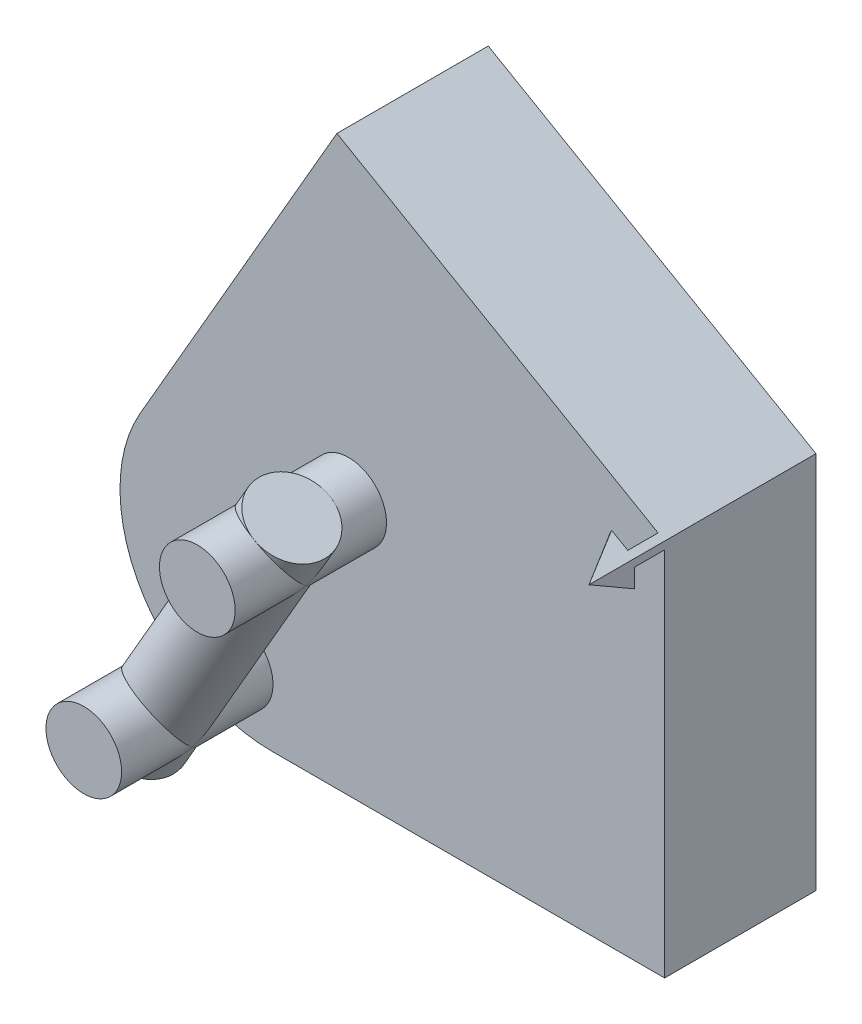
ISO-10303-21;
HEADER;
FILE_DESCRIPTION(('STEP AP214'),'2;1');
FILE_NAME('part.step','',(''),(''),'','','');
FILE_SCHEMA(('AUTOMOTIVE_DESIGN { 1 0 10303 214 1 1 1 1 }'));
ENDSEC;
DATA;
#1=APPLICATION_CONTEXT('core data for automotive mechanical design processes');
#2=APPLICATION_PROTOCOL_DEFINITION('international standard','automotive_design',2000,#1);
#3=PRODUCT_CONTEXT('',#1,'mechanical');
#4=PRODUCT('Part','Part','',(#3));
#5=PRODUCT_RELATED_PRODUCT_CATEGORY('part','',(#4));
#6=PRODUCT_DEFINITION_FORMATION('','',#4);
#7=PRODUCT_DEFINITION_CONTEXT('part definition',#1,'design');
#8=PRODUCT_DEFINITION('design','',#6,#7);
#9=PRODUCT_DEFINITION_SHAPE('','',#8);
#10=(LENGTH_UNIT() NAMED_UNIT(*) SI_UNIT(.MILLI.,.METRE.));
#11=(NAMED_UNIT(*) PLANE_ANGLE_UNIT() SI_UNIT($,.RADIAN.));
#12=(NAMED_UNIT(*) SI_UNIT($,.STERADIAN.) SOLID_ANGLE_UNIT());
#13=UNCERTAINTY_MEASURE_WITH_UNIT(LENGTH_MEASURE(1.E-05),#10,'distance_accuracy_value','');
#14=(GEOMETRIC_REPRESENTATION_CONTEXT(3) GLOBAL_UNCERTAINTY_ASSIGNED_CONTEXT((#13)) GLOBAL_UNIT_ASSIGNED_CONTEXT((#10,
#11,#12)) REPRESENTATION_CONTEXT('',''));
#15=CARTESIAN_POINT('',(0.,0.,0.));
#16=DIRECTION('',(0.,0.,1.));
#17=DIRECTION('',(1.,0.,0.));
#18=AXIS2_PLACEMENT_3D('',#15,#16,#17);
#19=CARTESIAN_POINT('',(-43.3012701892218,-25.,10.));
#20=DIRECTION('',(0.86602540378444,-0.499999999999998,0.));
#21=DIRECTION('',(0.499999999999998,0.86602540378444,0.));
#22=AXIS2_PLACEMENT_3D('',#19,#20,#21);
#23=PLANE('',#22);
#24=DIRECTION('',(0.,0.,-1.));
#25=VECTOR('',#24,1.);
#26=CARTESIAN_POINT('',(-21.650635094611,12.4999999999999,24.));
#27=LINE('',#26,#25);
#28=CARTESIAN_POINT('',(-21.650635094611,12.4999999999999,10.));
#29=VERTEX_POINT('',#28);
#30=CARTESIAN_POINT('',(-21.650635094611,12.4999999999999,0.));
#31=VERTEX_POINT('',#30);
#32=EDGE_CURVE('E129',#29,#31,#27,.T.);
#33=ORIENTED_EDGE('',*,*,#32,.T.);
#34=DIRECTION('',(-0.499999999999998,-0.86602540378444,0.));
#35=VECTOR('',#34,1.);
#36=CARTESIAN_POINT('',(-43.3012701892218,-25.,0.));
#37=LINE('',#36,#35);
#38=CARTESIAN_POINT('',(-34.6410161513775,-10.,0.));
#39=VERTEX_POINT('',#38);
#40=EDGE_CURVE('E141',#31,#39,#37,.T.);
#41=ORIENTED_EDGE('',*,*,#40,.T.);
#42=DIRECTION('',(0.,0.,-1.));
#43=VECTOR('',#42,1.);
#44=CARTESIAN_POINT('',(-34.6410161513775,-10.,10.));
#45=LINE('',#44,#43);
#46=CARTESIAN_POINT('',(-34.6410161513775,-10.,10.));
#47=VERTEX_POINT('',#46);
#48=EDGE_CURVE('E167',#39,#47,#45,.F.);
#49=ORIENTED_EDGE('',*,*,#48,.T.);
#50=DIRECTION('',(-0.499999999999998,-0.86602540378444,0.));
#51=VECTOR('',#50,1.);
#52=CARTESIAN_POINT('',(-43.3012701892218,-25.,10.));
#53=LINE('',#52,#51);
#54=EDGE_CURVE('E143',#29,#47,#53,.T.);
#55=ORIENTED_EDGE('',*,*,#54,.F.);
#56=EDGE_LOOP('',(#33,#41,#49,#55));
#57=FACE_BOUND('',#56,.T.);
#58=ADVANCED_FACE('F36',(#57),#23,.F.);
#59=CARTESIAN_POINT('',(43.3012701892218,-25.,10.));
#60=DIRECTION('',(0.,1.,0.));
#61=DIRECTION('',(-1.,0.,0.));
#62=AXIS2_PLACEMENT_3D('',#59,#60,#61);
#63=PLANE('',#62);
#64=DIRECTION('',(0.,0.,-1.));
#65=VECTOR('',#64,1.);
#66=CARTESIAN_POINT('',(0.,-25.,24.));
#67=LINE('',#66,#65);
#68=CARTESIAN_POINT('',(0.,-25.,10.));
#69=VERTEX_POINT('',#68);
#70=CARTESIAN_POINT('',(0.,-25.,0.));
#71=VERTEX_POINT('',#70);
#72=EDGE_CURVE('E226',#69,#71,#67,.T.);
#73=ORIENTED_EDGE('',*,*,#72,.F.);
#74=DIRECTION('',(1.,0.,0.));
#75=VECTOR('',#74,1.);
#76=CARTESIAN_POINT('',(43.3012701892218,-25.,10.));
#77=LINE('',#76,#75);
#78=CARTESIAN_POINT('',(-25.9807621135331,-25.,10.));
#79=VERTEX_POINT('',#78);
#80=EDGE_CURVE('E158',#79,#69,#77,.T.);
#81=ORIENTED_EDGE('',*,*,#80,.F.);
#82=DIRECTION('',(0.,0.,-1.));
#83=VECTOR('',#82,1.);
#84=CARTESIAN_POINT('',(-25.9807621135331,-25.,10.));
#85=LINE('',#84,#83);
#86=CARTESIAN_POINT('',(-25.9807621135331,-25.,0.));
#87=VERTEX_POINT('',#86);
#88=EDGE_CURVE('E162',#79,#87,#85,.T.);
#89=ORIENTED_EDGE('',*,*,#88,.T.);
#90=DIRECTION('',(1.,0.,0.));
#91=VECTOR('',#90,1.);
#92=CARTESIAN_POINT('',(43.3012701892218,-25.,0.));
#93=LINE('',#92,#91);
#94=EDGE_CURVE('E149',#87,#71,#93,.T.);
#95=ORIENTED_EDGE('',*,*,#94,.T.);
#96=EDGE_LOOP('',(#73,#81,#89,#95));
#97=FACE_BOUND('',#96,.T.);
#98=ADVANCED_FACE('F225',(#97),#63,.F.);
#99=CARTESIAN_POINT('',(43.3012701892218,-25.,10.));
#100=DIRECTION('',(0.,0.,-1.));
#101=DIRECTION('',(-1.,0.,0.));
#102=AXIS2_PLACEMENT_3D('',#99,#100,#101);
#103=PLANE('',#102);
#104=CARTESIAN_POINT('',(-28.3743556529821,-21.1458256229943,10.));
#105=DIRECTION('',(0.,0.,-1.));
#106=DIRECTION('',(-1.,0.,0.));
#107=AXIS2_PLACEMENT_3D('',#104,#105,#106);
#108=CIRCLE('',#107,2.5);
#109=CARTESIAN_POINT('',(-30.8743556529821,-21.1458256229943,10.));
#110=VERTEX_POINT('',#109);
#111=EDGE_CURVE('E150',#110,#110,#108,.T.);
#112=ORIENTED_EDGE('',*,*,#111,.T.);
#113=EDGE_LOOP('',(#112));
#114=FACE_BOUND('',#113,.T.);
#115=CARTESIAN_POINT('',(-20.8743556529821,-8.15544456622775,10.));
#116=DIRECTION('',(0.,0.,-1.));
#117=DIRECTION('',(-1.,0.,0.));
#118=AXIS2_PLACEMENT_3D('',#115,#116,#117);
#119=CIRCLE('',#118,2.5);
#120=CARTESIAN_POINT('',(-23.3743556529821,-8.15544456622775,10.));
#121=VERTEX_POINT('',#120);
#122=EDGE_CURVE('E209',#121,#121,#119,.T.);
#123=ORIENTED_EDGE('',*,*,#122,.T.);
#124=EDGE_LOOP('',(#123));
#125=FACE_BOUND('',#124,.T.);
#126=DIRECTION('',(0.86602540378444,-0.499999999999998,0.));
#127=VECTOR('',#126,1.);
#128=CARTESIAN_POINT('',(43.3012701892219,-24.9999999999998,10.));
#129=LINE('',#128,#127);
#130=CARTESIAN_POINT('',(-0.43301270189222,0.249999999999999,10.));
#131=VERTEX_POINT('',#130);
#132=EDGE_CURVE('E301',#29,#131,#129,.T.);
#133=ORIENTED_EDGE('',*,*,#132,.F.);
#134=ORIENTED_EDGE('',*,*,#54,.T.);
#135=CARTESIAN_POINT('',(-25.9807621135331,-15.,10.));
#136=DIRECTION('',(0.,0.,-1.));
#137=DIRECTION('',(-1.,0.,0.));
#138=AXIS2_PLACEMENT_3D('',#135,#136,#137);
#139=CIRCLE('',#138,10.);
#140=EDGE_CURVE('E165',#47,#79,#139,.F.);
#141=ORIENTED_EDGE('',*,*,#140,.T.);
#142=ORIENTED_EDGE('',*,*,#80,.T.);
#143=DIRECTION('',(0.,-1.,0.));
#144=VECTOR('',#143,1.);
#145=CARTESIAN_POINT('',(0.,-25.,10.));
#146=LINE('',#145,#144);
#147=CARTESIAN_POINT('',(0.,-0.5,10.));
#148=VERTEX_POINT('',#147);
#149=EDGE_CURVE('E219',#148,#69,#146,.T.);
#150=ORIENTED_EDGE('',*,*,#149,.F.);
#151=CARTESIAN_POINT('',(0.,0.,10.));
#152=DIRECTION('',(0.,0.,-1.));
#153=DIRECTION('',(0.,1.,0.));
#154=AXIS2_PLACEMENT_3D('',#151,#152,#153);
#155=CIRCLE('',#154,0.5);
#156=EDGE_CURVE('E308',#148,#131,#155,.T.);
#157=ORIENTED_EDGE('',*,*,#156,.T.);
#158=EDGE_LOOP('',(#133,#134,#141,#142,#150,#157));
#159=FACE_BOUND('',#158,.T.);
#160=ADVANCED_FACE('F217',(#114,#125,#159),#103,.F.);
#161=CARTESIAN_POINT('',(43.3012701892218,-25.,0.));
#162=DIRECTION('',(0.,0.,-1.));
#163=DIRECTION('',(-1.,0.,0.));
#164=AXIS2_PLACEMENT_3D('',#161,#162,#163);
#165=PLANE('',#164);
#166=ORIENTED_EDGE('',*,*,#40,.F.);
#167=DIRECTION('',(0.86602540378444,-0.499999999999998,0.));
#168=VECTOR('',#167,1.);
#169=CARTESIAN_POINT('',(-21.650635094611,12.4999999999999,0.));
#170=LINE('',#169,#168);
#171=CARTESIAN_POINT('',(0.,0.,0.));
#172=VERTEX_POINT('',#171);
#173=EDGE_CURVE('E126',#31,#172,#170,.T.);
#174=ORIENTED_EDGE('',*,*,#173,.T.);
#175=DIRECTION('',(0.,-1.,0.));
#176=VECTOR('',#175,1.);
#177=CARTESIAN_POINT('',(0.,0.,0.));
#178=LINE('',#177,#176);
#179=EDGE_CURVE('E136',#172,#71,#178,.T.);
#180=ORIENTED_EDGE('',*,*,#179,.T.);
#181=ORIENTED_EDGE('',*,*,#94,.F.);
#182=CARTESIAN_POINT('',(-25.9807621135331,-15.,0.));
#183=DIRECTION('',(0.,0.,-1.));
#184=DIRECTION('',(-1.,0.,0.));
#185=AXIS2_PLACEMENT_3D('',#182,#183,#184);
#186=CIRCLE('',#185,10.);
#187=EDGE_CURVE('E147',#87,#39,#186,.T.);
#188=ORIENTED_EDGE('',*,*,#187,.T.);
#189=EDGE_LOOP('',(#166,#174,#180,#181,#188));
#190=FACE_BOUND('',#189,.T.);
#191=ADVANCED_FACE('F145',(#190),#165,.T.);
#192=CARTESIAN_POINT('',(0.,0.,0.));
#193=DIRECTION('',(0.,0.,-1.));
#194=DIRECTION('',(0.,1.,0.));
#195=AXIS2_PLACEMENT_3D('',#192,#193,#194);
#196=CYLINDRICAL_SURFACE('',#195,0.5);
#197=CARTESIAN_POINT('',(0.,0.,12.));
#198=DIRECTION('',(0.,0.,-1.));
#199=DIRECTION('',(0.,1.,0.));
#200=AXIS2_PLACEMENT_3D('',#197,#198,#199);
#201=CIRCLE('',#200,0.5);
#202=CARTESIAN_POINT('',(0.,-0.5,12.));
#203=VERTEX_POINT('',#202);
#204=CARTESIAN_POINT('',(-0.43301270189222,0.249999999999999,12.));
#205=VERTEX_POINT('',#204);
#206=EDGE_CURVE('E303',#203,#205,#201,.T.);
#207=ORIENTED_EDGE('',*,*,#206,.T.);
#208=DIRECTION('',(0.,0.,-1.));
#209=VECTOR('',#208,1.);
#210=CARTESIAN_POINT('',(-0.43301270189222,0.249999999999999,0.));
#211=LINE('',#210,#209);
#212=EDGE_CURVE('E294',#205,#131,#211,.T.);
#213=ORIENTED_EDGE('',*,*,#212,.T.);
#214=ORIENTED_EDGE('',*,*,#156,.F.);
#215=DIRECTION('',(0.,0.,-1.));
#216=VECTOR('',#215,1.);
#217=CARTESIAN_POINT('',(0.,-0.5,0.));
#218=LINE('',#217,#216);
#219=EDGE_CURVE('E290',#148,#203,#218,.F.);
#220=ORIENTED_EDGE('',*,*,#219,.T.);
#221=EDGE_LOOP('',(#207,#213,#214,#220));
#222=FACE_BOUND('',#221,.T.);
#223=ADVANCED_FACE('F247',(#222),#196,.T.);
#224=CARTESIAN_POINT('',(0.,0.,12.));
#225=DIRECTION('',(0.,0.,-1.));
#226=DIRECTION('',(0.,1.,0.));
#227=AXIS2_PLACEMENT_3D('',#224,#225,#226);
#228=CONICAL_SURFACE('',#227,1.7320508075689,0.523598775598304);
#229=DIRECTION('',(0.,-0.500000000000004,-0.866025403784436));
#230=VECTOR('',#229,1.);
#231=CARTESIAN_POINT('',(0.,0.,15.));
#232=LINE('',#231,#230);
#233=CARTESIAN_POINT('',(0.,-1.7320508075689,12.));
#234=VERTEX_POINT('',#233);
#235=CARTESIAN_POINT('',(0.,0.,15.));
#236=VERTEX_POINT('',#235);
#237=EDGE_CURVE('E51',#234,#236,#232,.F.);
#238=ORIENTED_EDGE('',*,*,#237,.T.);
#239=DIRECTION('',(0.433012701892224,-0.250000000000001,0.866025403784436));
#240=VECTOR('',#239,1.);
#241=CARTESIAN_POINT('',(0.,0.,15.));
#242=LINE('',#241,#240);
#243=CARTESIAN_POINT('',(-1.50000000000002,0.866025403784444,12.));
#244=VERTEX_POINT('',#243);
#245=EDGE_CURVE('E291',#236,#244,#242,.F.);
#246=ORIENTED_EDGE('',*,*,#245,.T.);
#247=CARTESIAN_POINT('',(0.,0.,12.));
#248=DIRECTION('',(0.,0.,-1.));
#249=DIRECTION('',(0.,1.,0.));
#250=AXIS2_PLACEMENT_3D('',#247,#248,#249);
#251=CIRCLE('',#250,1.7320508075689);
#252=EDGE_CURVE('E306',#234,#244,#251,.T.);
#253=ORIENTED_EDGE('',*,*,#252,.F.);
#254=EDGE_LOOP('',(#238,#246,#253));
#255=FACE_BOUND('',#254,.T.);
#256=ADVANCED_FACE('F275',(#255),#228,.T.);
#257=CARTESIAN_POINT('',(-0.249999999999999,-0.43301270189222,12.));
#258=DIRECTION('',(0.,0.,-1.));
#259=DIRECTION('',(0.,1.,0.));
#260=AXIS2_PLACEMENT_3D('',#257,#258,#259);
#261=PLANE('',#260);
#262=ORIENTED_EDGE('',*,*,#252,.T.);
#263=DIRECTION('',(0.86602540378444,-0.499999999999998,0.));
#264=VECTOR('',#263,1.);
#265=CARTESIAN_POINT('',(0.,0.,12.));
#266=LINE('',#265,#264);
#267=EDGE_CURVE('E11',#244,#205,#266,.T.);
#268=ORIENTED_EDGE('',*,*,#267,.T.);
#269=ORIENTED_EDGE('',*,*,#206,.F.);
#270=DIRECTION('',(0.,-1.,0.));
#271=VECTOR('',#270,1.);
#272=CARTESIAN_POINT('',(0.,-0.43301270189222,12.));
#273=LINE('',#272,#271);
#274=EDGE_CURVE('E44',#203,#234,#273,.T.);
#275=ORIENTED_EDGE('',*,*,#274,.T.);
#276=EDGE_LOOP('',(#262,#268,#269,#275));
#277=FACE_BOUND('',#276,.T.);
#278=ADVANCED_FACE('F279',(#277),#261,.T.);
#279=CARTESIAN_POINT('',(-29.6243556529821,-23.3108891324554,15.));
#280=DIRECTION('',(0.499999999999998,0.86602540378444,0.));
#281=DIRECTION('',(-0.86602540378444,0.499999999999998,0.));
#282=AXIS2_PLACEMENT_3D('',#279,#280,#281);
#283=CYLINDRICAL_SURFACE('',#282,2.5);
#284=CARTESIAN_POINT('',(-28.3743556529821,-21.1458256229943,15.));
#285=DIRECTION('',(0.353553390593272,0.612372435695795,0.707106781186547));
#286=DIRECTION('',(-0.353553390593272,-0.612372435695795,0.707106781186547));
#287=AXIS2_PLACEMENT_3D('',#284,#285,#286);
#288=ELLIPSE('',#287,3.53553390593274,2.5);
#289=CARTESIAN_POINT('',(-30.5394191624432,-19.8958256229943,15.));
#290=VERTEX_POINT('',#289);
#291=CARTESIAN_POINT('',(-26.209292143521,-22.3958256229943,15.));
#292=VERTEX_POINT('',#291);
#293=EDGE_CURVE('E179',#290,#292,#288,.F.);
#294=ORIENTED_EDGE('',*,*,#293,.F.);
#295=CARTESIAN_POINT('',(-28.3743556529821,-21.1458256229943,15.));
#296=DIRECTION('',(-0.353553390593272,-0.612372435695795,0.707106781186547));
#297=DIRECTION('',(0.353553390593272,0.612372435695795,0.707106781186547));
#298=AXIS2_PLACEMENT_3D('',#295,#296,#297);
#299=ELLIPSE('',#298,3.53553390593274,2.5);
#300=EDGE_CURVE('E171',#292,#290,#299,.T.);
#301=ORIENTED_EDGE('',*,*,#300,.F.);
#302=EDGE_LOOP('',(#294,#301));
#303=FACE_BOUND('',#302,.T.);
#304=CARTESIAN_POINT('',(-20.8743556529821,-8.15544456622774,15.));
#305=DIRECTION('',(0.353553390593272,0.612372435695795,-0.707106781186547));
#306=DIRECTION('',(0.353553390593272,0.612372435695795,0.707106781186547));
#307=AXIS2_PLACEMENT_3D('',#304,#305,#306);
#308=ELLIPSE('',#307,3.53553390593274,2.5);
#309=CARTESIAN_POINT('',(-23.0394191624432,-6.90544456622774,15.));
#310=VERTEX_POINT('',#309);
#311=CARTESIAN_POINT('',(-18.709292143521,-9.40544456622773,15.));
#312=VERTEX_POINT('',#311);
#313=EDGE_CURVE('E58',#310,#312,#308,.F.);
#314=ORIENTED_EDGE('',*,*,#313,.T.);
#315=CARTESIAN_POINT('',(-20.8743556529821,-8.15544456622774,15.));
#316=DIRECTION('',(0.353553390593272,0.612372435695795,0.707106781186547));
#317=DIRECTION('',(0.353553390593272,0.612372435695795,-0.707106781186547));
#318=AXIS2_PLACEMENT_3D('',#315,#316,#317);
#319=ELLIPSE('',#318,3.53553390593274,2.5);
#320=EDGE_CURVE('E321',#312,#310,#319,.F.);
#321=ORIENTED_EDGE('',*,*,#320,.T.);
#322=EDGE_LOOP('',(#314,#321));
#323=FACE_BOUND('',#322,.T.);
#324=ADVANCED_FACE('F235',(#303,#323),#283,.T.);
#325=CARTESIAN_POINT('',(-28.3743556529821,-21.1458256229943,0.));
#326=DIRECTION('',(0.,0.,1.));
#327=DIRECTION('',(1.,0.,0.));
#328=AXIS2_PLACEMENT_3D('',#325,#326,#327);
#329=CYLINDRICAL_SURFACE('',#328,2.5);
#330=ORIENTED_EDGE('',*,*,#111,.F.);
#331=EDGE_LOOP('',(#330));
#332=FACE_BOUND('',#331,.T.);
#333=ORIENTED_EDGE('',*,*,#293,.T.);
#334=CARTESIAN_POINT('',(-28.3743556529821,-21.1458256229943,15.));
#335=DIRECTION('',(-0.353553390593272,-0.612372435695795,0.707106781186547));
#336=DIRECTION('',(0.353553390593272,0.612372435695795,0.707106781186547));
#337=AXIS2_PLACEMENT_3D('',#334,#335,#336);
#338=ELLIPSE('',#337,3.53553390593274,2.5);
#339=CARTESIAN_POINT('',(-29.6243556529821,-23.3108891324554,12.5));
#340=VERTEX_POINT('',#339);
#341=EDGE_CURVE('E172',#292,#340,#338,.F.);
#342=ORIENTED_EDGE('',*,*,#341,.T.);
#343=EDGE_CURVE('E169',#340,#290,#338,.F.);
#344=ORIENTED_EDGE('',*,*,#343,.T.);
#345=EDGE_LOOP('',(#333,#342,#344));
#346=FACE_BOUND('',#345,.T.);
#347=ADVANCED_FACE('F188',(#332,#346),#329,.T.);
#348=CARTESIAN_POINT('',(-25.9807621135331,-15.,10.));
#349=DIRECTION('',(0.,0.,-1.));
#350=DIRECTION('',(-1.,0.,0.));
#351=AXIS2_PLACEMENT_3D('',#348,#349,#350);
#352=CYLINDRICAL_SURFACE('',#351,10.);
#353=ORIENTED_EDGE('',*,*,#140,.F.);
#354=ORIENTED_EDGE('',*,*,#48,.F.);
#355=ORIENTED_EDGE('',*,*,#187,.F.);
#356=ORIENTED_EDGE('',*,*,#88,.F.);
#357=EDGE_LOOP('',(#353,#354,#355,#356));
#358=FACE_BOUND('',#357,.T.);
#359=ADVANCED_FACE('F38',(#358),#352,.T.);
#360=CARTESIAN_POINT('',(-29.6243556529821,-23.3108891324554,15.));
#361=DIRECTION('',(-0.499999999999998,-0.86602540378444,0.));
#362=DIRECTION('',(0.86602540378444,-0.499999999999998,0.));
#363=AXIS2_PLACEMENT_3D('',#360,#361,#362);
#364=PLANE('',#363);
#365=CARTESIAN_POINT('',(-29.6243556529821,-23.3108891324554,15.));
#366=DIRECTION('',(-0.499999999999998,-0.86602540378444,0.));
#367=DIRECTION('',(0.86602540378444,-0.499999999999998,0.));
#368=AXIS2_PLACEMENT_3D('',#365,#366,#367);
#369=CIRCLE('',#368,2.5);
#370=CARTESIAN_POINT('',(-29.6243556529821,-23.3108891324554,17.5));
#371=VERTEX_POINT('',#370);
#372=EDGE_CURVE('E199',#371,#340,#369,.T.);
#373=ORIENTED_EDGE('',*,*,#372,.T.);
#374=EDGE_CURVE('E195',#340,#371,#369,.T.);
#375=ORIENTED_EDGE('',*,*,#374,.T.);
#376=EDGE_LOOP('',(#373,#375));
#377=FACE_BOUND('',#376,.T.);
#378=ADVANCED_FACE('F202',(#377),#364,.T.);
#379=CARTESIAN_POINT('',(-28.3743556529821,-21.1458256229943,15.));
#380=DIRECTION('',(0.353553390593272,0.612372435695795,0.707106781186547));
#381=DIRECTION('',(-0.353553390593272,-0.612372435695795,0.707106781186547));
#382=AXIS2_PLACEMENT_3D('',#379,#380,#381);
#383=ELLIPSE('',#382,3.53553390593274,2.5);
#384=EDGE_CURVE('E178',#290,#371,#383,.T.);
#385=ORIENTED_EDGE('',*,*,#384,.F.);
#386=ORIENTED_EDGE('',*,*,#343,.F.);
#387=ORIENTED_EDGE('',*,*,#372,.F.);
#388=EDGE_LOOP('',(#385,#386,#387));
#389=FACE_BOUND('',#388,.T.);
#390=ADVANCED_FACE('F233',(#389),#283,.T.);
#391=EDGE_CURVE('E175',#371,#292,#383,.T.);
#392=ORIENTED_EDGE('',*,*,#391,.F.);
#393=ORIENTED_EDGE('',*,*,#374,.F.);
#394=ORIENTED_EDGE('',*,*,#341,.F.);
#395=EDGE_LOOP('',(#392,#393,#394));
#396=FACE_BOUND('',#395,.T.);
#397=ADVANCED_FACE('F193',(#396),#283,.T.);
#398=CARTESIAN_POINT('',(-28.3743556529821,-21.1458256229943,20.));
#399=DIRECTION('',(0.,0.,1.));
#400=DIRECTION('',(1.,0.,0.));
#401=AXIS2_PLACEMENT_3D('',#398,#399,#400);
#402=PLANE('',#401);
#403=CARTESIAN_POINT('',(-28.3743556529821,-21.1458256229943,20.));
#404=DIRECTION('',(0.,0.,1.));
#405=DIRECTION('',(1.,0.,0.));
#406=AXIS2_PLACEMENT_3D('',#403,#404,#405);
#407=CIRCLE('',#406,2.5);
#408=CARTESIAN_POINT('',(-25.8743556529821,-21.1458256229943,20.));
#409=VERTEX_POINT('',#408);
#410=EDGE_CURVE('E155',#409,#409,#407,.T.);
#411=ORIENTED_EDGE('',*,*,#410,.T.);
#412=EDGE_LOOP('',(#411));
#413=FACE_BOUND('',#412,.T.);
#414=ADVANCED_FACE('F251',(#413),#402,.T.);
#415=ORIENTED_EDGE('',*,*,#410,.F.);
#416=EDGE_LOOP('',(#415));
#417=FACE_BOUND('',#416,.T.);
#418=ORIENTED_EDGE('',*,*,#300,.T.);
#419=ORIENTED_EDGE('',*,*,#384,.T.);
#420=ORIENTED_EDGE('',*,*,#391,.T.);
#421=EDGE_LOOP('',(#418,#419,#420));
#422=FACE_BOUND('',#421,.T.);
#423=ADVANCED_FACE('F238',(#417,#422),#329,.T.);
#424=CARTESIAN_POINT('',(-20.8743556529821,-8.15544456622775,0.));
#425=DIRECTION('',(0.,0.,1.));
#426=DIRECTION('',(1.,0.,0.));
#427=AXIS2_PLACEMENT_3D('',#424,#425,#426);
#428=CYLINDRICAL_SURFACE('',#427,2.5);
#429=ORIENTED_EDGE('',*,*,#313,.F.);
#430=CARTESIAN_POINT('',(-20.8743556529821,-8.15544456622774,15.));
#431=DIRECTION('',(0.353553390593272,0.612372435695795,0.707106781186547));
#432=DIRECTION('',(0.353553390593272,0.612372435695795,-0.707106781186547));
#433=AXIS2_PLACEMENT_3D('',#430,#431,#432);
#434=ELLIPSE('',#433,3.53553390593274,2.5);
#435=CARTESIAN_POINT('',(-19.6243556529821,-5.99038105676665,12.5));
#436=VERTEX_POINT('',#435);
#437=EDGE_CURVE('E316',#436,#310,#434,.T.);
#438=ORIENTED_EDGE('',*,*,#437,.F.);
#439=EDGE_CURVE('E320',#312,#436,#434,.T.);
#440=ORIENTED_EDGE('',*,*,#439,.F.);
#441=EDGE_LOOP('',(#429,#438,#440));
#442=FACE_BOUND('',#441,.T.);
#443=ORIENTED_EDGE('',*,*,#122,.F.);
#444=EDGE_LOOP('',(#443));
#445=FACE_BOUND('',#444,.T.);
#446=ADVANCED_FACE('F263',(#442,#445),#428,.T.);
#447=CARTESIAN_POINT('',(-19.6243556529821,-5.99038105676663,15.));
#448=DIRECTION('',(-0.499999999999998,-0.86602540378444,0.));
#449=DIRECTION('',(0.86602540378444,-0.499999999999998,0.));
#450=AXIS2_PLACEMENT_3D('',#447,#448,#449);
#451=PLANE('',#450);
#452=CARTESIAN_POINT('',(-19.6243556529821,-5.99038105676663,15.));
#453=DIRECTION('',(-0.499999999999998,-0.86602540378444,0.));
#454=DIRECTION('',(0.86602540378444,-0.499999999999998,0.));
#455=AXIS2_PLACEMENT_3D('',#452,#453,#454);
#456=CIRCLE('',#455,2.5);
#457=CARTESIAN_POINT('',(-19.6243556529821,-5.99038105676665,17.5));
#458=VERTEX_POINT('',#457);
#459=EDGE_CURVE('E212',#436,#458,#456,.T.);
#460=ORIENTED_EDGE('',*,*,#459,.F.);
#461=EDGE_CURVE('E200',#458,#436,#456,.T.);
#462=ORIENTED_EDGE('',*,*,#461,.F.);
#463=EDGE_LOOP('',(#460,#462));
#464=FACE_BOUND('',#463,.T.);
#465=ADVANCED_FACE('F261',(#464),#451,.F.);
#466=CARTESIAN_POINT('',(-20.8743556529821,-8.15544456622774,15.));
#467=DIRECTION('',(0.353553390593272,0.612372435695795,-0.707106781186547));
#468=DIRECTION('',(0.353553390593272,0.612372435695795,0.707106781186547));
#469=AXIS2_PLACEMENT_3D('',#466,#467,#468);
#470=ELLIPSE('',#469,3.53553390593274,2.5);
#471=EDGE_CURVE('E313',#458,#312,#470,.T.);
#472=ORIENTED_EDGE('',*,*,#471,.T.);
#473=ORIENTED_EDGE('',*,*,#439,.T.);
#474=ORIENTED_EDGE('',*,*,#459,.T.);
#475=EDGE_LOOP('',(#472,#473,#474));
#476=FACE_BOUND('',#475,.T.);
#477=ADVANCED_FACE('F259',(#476),#283,.T.);
#478=ORIENTED_EDGE('',*,*,#461,.T.);
#479=ORIENTED_EDGE('',*,*,#437,.T.);
#480=EDGE_CURVE('E317',#310,#458,#470,.T.);
#481=ORIENTED_EDGE('',*,*,#480,.T.);
#482=EDGE_LOOP('',(#478,#479,#481));
#483=FACE_BOUND('',#482,.T.);
#484=ADVANCED_FACE('F255',(#483),#283,.T.);
#485=CARTESIAN_POINT('',(-20.8743556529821,-8.15544456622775,20.));
#486=DIRECTION('',(0.,0.,1.));
#487=DIRECTION('',(1.,0.,0.));
#488=AXIS2_PLACEMENT_3D('',#485,#486,#487);
#489=CIRCLE('',#488,2.5);
#490=CARTESIAN_POINT('',(-18.3743556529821,-8.15544456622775,20.));
#491=VERTEX_POINT('',#490);
#492=EDGE_CURVE('E310',#491,#491,#489,.T.);
#493=ORIENTED_EDGE('',*,*,#492,.F.);
#494=EDGE_LOOP('',(#493));
#495=FACE_BOUND('',#494,.T.);
#496=ORIENTED_EDGE('',*,*,#480,.F.);
#497=ORIENTED_EDGE('',*,*,#320,.F.);
#498=ORIENTED_EDGE('',*,*,#471,.F.);
#499=EDGE_LOOP('',(#496,#497,#498));
#500=FACE_BOUND('',#499,.T.);
#501=ADVANCED_FACE('F258',(#495,#500),#428,.T.);
#502=CARTESIAN_POINT('',(-20.8743556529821,-8.15544456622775,20.));
#503=DIRECTION('',(0.,0.,1.));
#504=DIRECTION('',(1.,0.,0.));
#505=AXIS2_PLACEMENT_3D('',#502,#503,#504);
#506=PLANE('',#505);
#507=ORIENTED_EDGE('',*,*,#492,.T.);
#508=EDGE_LOOP('',(#507));
#509=FACE_BOUND('',#508,.T.);
#510=ADVANCED_FACE('F269',(#509),#506,.T.);
#511=CARTESIAN_POINT('',(-21.650635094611,12.4999999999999,24.));
#512=DIRECTION('',(0.499999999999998,0.86602540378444,0.));
#513=DIRECTION('',(-0.86602540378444,0.499999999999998,0.));
#514=AXIS2_PLACEMENT_3D('',#511,#512,#513);
#515=PLANE('',#514);
#516=ORIENTED_EDGE('',*,*,#132,.T.);
#517=ORIENTED_EDGE('',*,*,#212,.F.);
#518=ORIENTED_EDGE('',*,*,#267,.F.);
#519=ORIENTED_EDGE('',*,*,#245,.F.);
#520=DIRECTION('',(0.,0.,-1.));
#521=VECTOR('',#520,1.);
#522=CARTESIAN_POINT('',(0.,0.,24.));
#523=LINE('',#522,#521);
#524=EDGE_CURVE('E131',#236,#172,#523,.T.);
#525=ORIENTED_EDGE('',*,*,#524,.T.);
#526=ORIENTED_EDGE('',*,*,#173,.F.);
#527=ORIENTED_EDGE('',*,*,#32,.F.);
#528=EDGE_LOOP('',(#516,#517,#518,#519,#525,#526,#527));
#529=FACE_BOUND('',#528,.T.);
#530=ADVANCED_FACE('F128',(#529),#515,.T.);
#531=CARTESIAN_POINT('',(0.,0.,24.));
#532=DIRECTION('',(1.,0.,0.));
#533=DIRECTION('',(0.,1.,0.));
#534=AXIS2_PLACEMENT_3D('',#531,#532,#533);
#535=PLANE('',#534);
#536=ORIENTED_EDGE('',*,*,#149,.T.);
#537=ORIENTED_EDGE('',*,*,#72,.T.);
#538=ORIENTED_EDGE('',*,*,#179,.F.);
#539=ORIENTED_EDGE('',*,*,#524,.F.);
#540=ORIENTED_EDGE('',*,*,#237,.F.);
#541=ORIENTED_EDGE('',*,*,#274,.F.);
#542=ORIENTED_EDGE('',*,*,#219,.F.);
#543=EDGE_LOOP('',(#536,#537,#538,#539,#540,#541,#542));
#544=FACE_BOUND('',#543,.T.);
#545=ADVANCED_FACE('F285',(#544),#535,.T.);
#546=CLOSED_SHELL('',(#58,#98,#160,#191,#223,#256,#278,#324,#347,#359,#378,#390,#397,#414,#423,
#446,#465,#477,#484,#501,#510,#530,#545));
#547=MANIFOLD_SOLID_BREP('B2',#546);
#548=ADVANCED_BREP_SHAPE_REPRESENTATION('',(#18,#547),#14);
#549=SHAPE_DEFINITION_REPRESENTATION(#9,#548);
ENDSEC;
END-ISO-10303-21;
